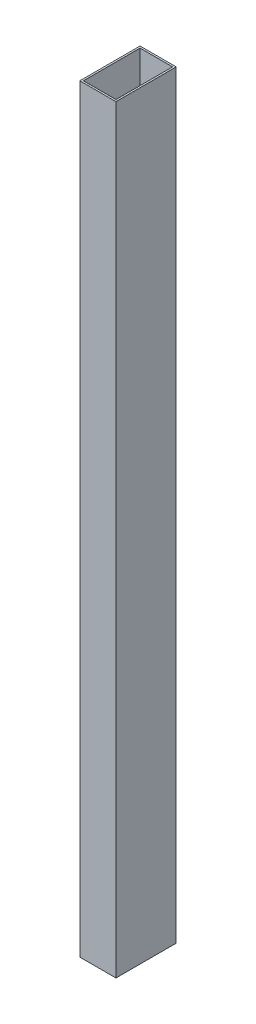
from build123d import *

# Parameters (mm, degrees)
SKETCH1_W           = 30
SKETCH1_H           = 50
BOSS_EXTRUDE1_DEPTH = 630
SHELL1_T            = -1.5


with BuildPart() as part:
    # Sketch1 → Boss-Extrude1 (new body)
    with BuildSketch(Plane(origin=(0, 0, 0), x_dir=(1, 0, 0), z_dir=(0, 1, 0))):
        Rectangle(SKETCH1_W, SKETCH1_H)
    extrude(amount=BOSS_EXTRUDE1_DEPTH)

    # Shell1
    shell1_openings = [part.faces().sort_by_distance(p)[0] for p in [
        (0, 630, 0),
        (0, 0, 0),
    ]]
    offset(amount=SHELL1_T, openings=shell1_openings, kind=Kind.INTERSECTION)


solid = part.part
